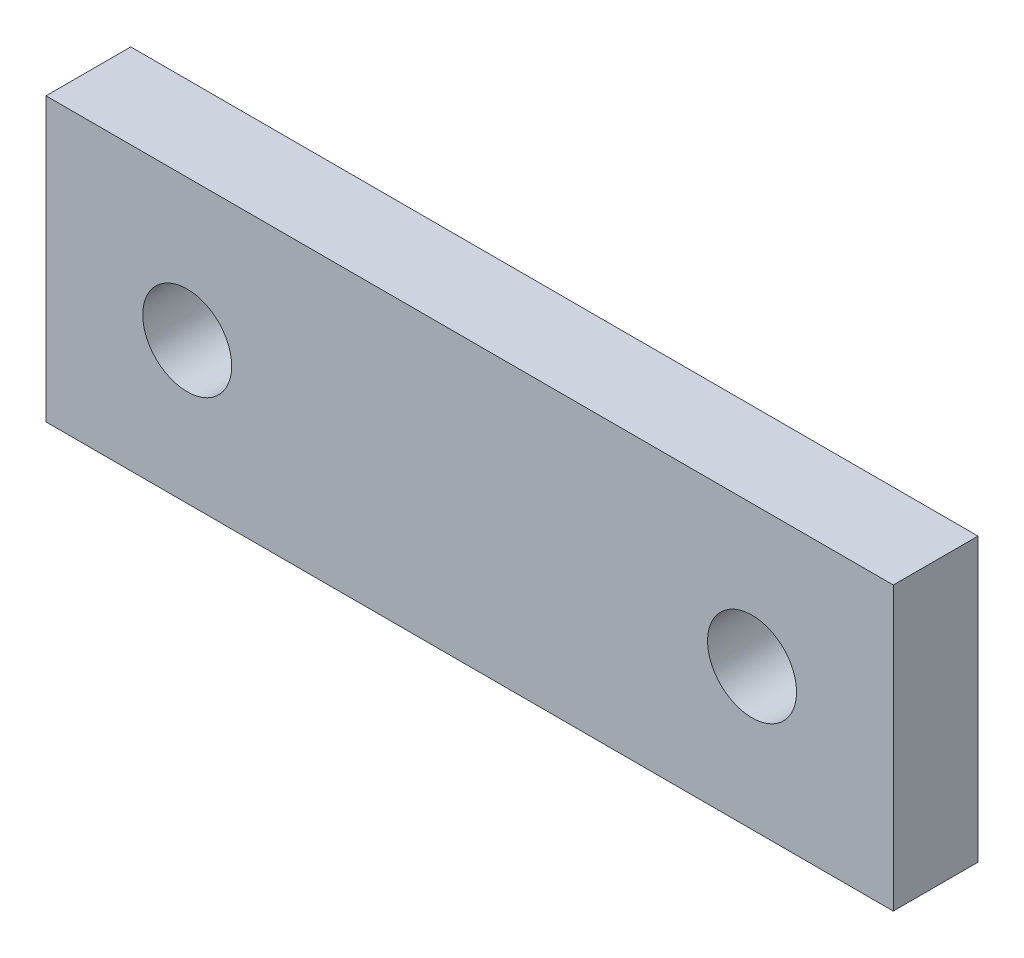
ISO-10303-21;
HEADER;
FILE_DESCRIPTION(('STEP AP214'),'2;1');
FILE_NAME('part.step','',(''),(''),'','','');
FILE_SCHEMA(('AUTOMOTIVE_DESIGN { 1 0 10303 214 1 1 1 1 }'));
ENDSEC;
DATA;
#1=APPLICATION_CONTEXT('core data for automotive mechanical design processes');
#2=APPLICATION_PROTOCOL_DEFINITION('international standard','automotive_design',2000,#1);
#3=PRODUCT_CONTEXT('',#1,'mechanical');
#4=PRODUCT('Part','Part','',(#3));
#5=PRODUCT_RELATED_PRODUCT_CATEGORY('part','',(#4));
#6=PRODUCT_DEFINITION_FORMATION('','',#4);
#7=PRODUCT_DEFINITION_CONTEXT('part definition',#1,'design');
#8=PRODUCT_DEFINITION('design','',#6,#7);
#9=PRODUCT_DEFINITION_SHAPE('','',#8);
#10=(LENGTH_UNIT() NAMED_UNIT(*) SI_UNIT(.MILLI.,.METRE.));
#11=(NAMED_UNIT(*) PLANE_ANGLE_UNIT() SI_UNIT($,.RADIAN.));
#12=(NAMED_UNIT(*) SI_UNIT($,.STERADIAN.) SOLID_ANGLE_UNIT());
#13=UNCERTAINTY_MEASURE_WITH_UNIT(LENGTH_MEASURE(1.E-05),#10,'distance_accuracy_value','');
#14=(GEOMETRIC_REPRESENTATION_CONTEXT(3) GLOBAL_UNCERTAINTY_ASSIGNED_CONTEXT((#13)) GLOBAL_UNIT_ASSIGNED_CONTEXT((#10,
#11,#12)) REPRESENTATION_CONTEXT('',''));
#15=CARTESIAN_POINT('',(0.,0.,0.));
#16=DIRECTION('',(0.,0.,1.));
#17=DIRECTION('',(1.,0.,0.));
#18=AXIS2_PLACEMENT_3D('',#15,#16,#17);
#19=CARTESIAN_POINT('',(38.1,-12.7,7.62));
#20=DIRECTION('',(-1.,0.,0.));
#21=DIRECTION('',(0.,0.,1.));
#22=AXIS2_PLACEMENT_3D('',#19,#20,#21);
#23=PLANE('',#22);
#24=DIRECTION('',(0.,1.,0.));
#25=VECTOR('',#24,1.);
#26=CARTESIAN_POINT('',(38.1,-12.7,0.));
#27=LINE('',#26,#25);
#28=CARTESIAN_POINT('',(38.1,-12.7,0.));
#29=VERTEX_POINT('',#28);
#30=CARTESIAN_POINT('',(38.1,12.7,0.));
#31=VERTEX_POINT('',#30);
#32=EDGE_CURVE('E111',#29,#31,#27,.T.);
#33=ORIENTED_EDGE('',*,*,#32,.T.);
#34=DIRECTION('',(0.,0.,-1.));
#35=VECTOR('',#34,1.);
#36=CARTESIAN_POINT('',(38.1,12.7,7.62));
#37=LINE('',#36,#35);
#38=CARTESIAN_POINT('',(38.1,12.7,7.62));
#39=VERTEX_POINT('',#38);
#40=EDGE_CURVE('E11',#39,#31,#37,.T.);
#41=ORIENTED_EDGE('',*,*,#40,.F.);
#42=DIRECTION('',(0.,1.,0.));
#43=VECTOR('',#42,1.);
#44=CARTESIAN_POINT('',(38.1,-12.7,7.62));
#45=LINE('',#44,#43);
#46=CARTESIAN_POINT('',(38.1,-12.7,7.62));
#47=VERTEX_POINT('',#46);
#48=EDGE_CURVE('E95',#47,#39,#45,.T.);
#49=ORIENTED_EDGE('',*,*,#48,.F.);
#50=DIRECTION('',(0.,0.,-1.));
#51=VECTOR('',#50,1.);
#52=CARTESIAN_POINT('',(38.1,-12.7,7.62));
#53=LINE('',#52,#51);
#54=EDGE_CURVE('E107',#47,#29,#53,.T.);
#55=ORIENTED_EDGE('',*,*,#54,.T.);
#56=EDGE_LOOP('',(#33,#41,#49,#55));
#57=FACE_BOUND('',#56,.T.);
#58=ADVANCED_FACE('F43',(#57),#23,.F.);
#59=CARTESIAN_POINT('',(-38.1,12.7,7.62));
#60=DIRECTION('',(0.,-1.,0.));
#61=DIRECTION('',(0.,0.,-1.));
#62=AXIS2_PLACEMENT_3D('',#59,#60,#61);
#63=PLANE('',#62);
#64=DIRECTION('',(-1.,0.,0.));
#65=VECTOR('',#64,1.);
#66=CARTESIAN_POINT('',(-38.1,12.7,0.));
#67=LINE('',#66,#65);
#68=CARTESIAN_POINT('',(-38.1,12.7,0.));
#69=VERTEX_POINT('',#68);
#70=EDGE_CURVE('E100',#31,#69,#67,.T.);
#71=ORIENTED_EDGE('',*,*,#70,.T.);
#72=DIRECTION('',(0.,0.,-1.));
#73=VECTOR('',#72,1.);
#74=CARTESIAN_POINT('',(-38.1,12.7,7.62));
#75=LINE('',#74,#73);
#76=CARTESIAN_POINT('',(-38.1,12.7,7.62));
#77=VERTEX_POINT('',#76);
#78=EDGE_CURVE('E52',#77,#69,#75,.T.);
#79=ORIENTED_EDGE('',*,*,#78,.F.);
#80=DIRECTION('',(-1.,0.,0.));
#81=VECTOR('',#80,1.);
#82=CARTESIAN_POINT('',(-38.1,12.7,7.62));
#83=LINE('',#82,#81);
#84=EDGE_CURVE('E90',#39,#77,#83,.T.);
#85=ORIENTED_EDGE('',*,*,#84,.F.);
#86=ORIENTED_EDGE('',*,*,#40,.T.);
#87=EDGE_LOOP('',(#71,#79,#85,#86));
#88=FACE_BOUND('',#87,.T.);
#89=ADVANCED_FACE('F99',(#88),#63,.F.);
#90=CARTESIAN_POINT('',(-38.1,-12.7,7.62));
#91=DIRECTION('',(1.,0.,0.));
#92=DIRECTION('',(0.,0.,-1.));
#93=AXIS2_PLACEMENT_3D('',#90,#91,#92);
#94=PLANE('',#93);
#95=DIRECTION('',(0.,-1.,0.));
#96=VECTOR('',#95,1.);
#97=CARTESIAN_POINT('',(-38.1,-12.7,0.));
#98=LINE('',#97,#96);
#99=CARTESIAN_POINT('',(-38.1,-12.7,0.));
#100=VERTEX_POINT('',#99);
#101=EDGE_CURVE('E77',#69,#100,#98,.T.);
#102=ORIENTED_EDGE('',*,*,#101,.T.);
#103=DIRECTION('',(0.,0.,-1.));
#104=VECTOR('',#103,1.);
#105=CARTESIAN_POINT('',(-38.1,-12.7,7.62));
#106=LINE('',#105,#104);
#107=CARTESIAN_POINT('',(-38.1,-12.7,7.62));
#108=VERTEX_POINT('',#107);
#109=EDGE_CURVE('E102',#108,#100,#106,.T.);
#110=ORIENTED_EDGE('',*,*,#109,.F.);
#111=DIRECTION('',(0.,-1.,0.));
#112=VECTOR('',#111,1.);
#113=CARTESIAN_POINT('',(-38.1,-12.7,7.62));
#114=LINE('',#113,#112);
#115=EDGE_CURVE('E93',#77,#108,#114,.T.);
#116=ORIENTED_EDGE('',*,*,#115,.F.);
#117=ORIENTED_EDGE('',*,*,#78,.T.);
#118=EDGE_LOOP('',(#102,#110,#116,#117));
#119=FACE_BOUND('',#118,.T.);
#120=ADVANCED_FACE('F103',(#119),#94,.F.);
#121=CARTESIAN_POINT('',(-38.1,-12.7,7.62));
#122=DIRECTION('',(0.,1.,0.));
#123=DIRECTION('',(0.,0.,1.));
#124=AXIS2_PLACEMENT_3D('',#121,#122,#123);
#125=PLANE('',#124);
#126=DIRECTION('',(1.,0.,0.));
#127=VECTOR('',#126,1.);
#128=CARTESIAN_POINT('',(-38.1,-12.7,0.));
#129=LINE('',#128,#127);
#130=EDGE_CURVE('E83',#100,#29,#129,.T.);
#131=ORIENTED_EDGE('',*,*,#130,.T.);
#132=ORIENTED_EDGE('',*,*,#54,.F.);
#133=DIRECTION('',(1.,0.,0.));
#134=VECTOR('',#133,1.);
#135=CARTESIAN_POINT('',(-38.1,-12.7,7.62));
#136=LINE('',#135,#134);
#137=EDGE_CURVE('E60',#108,#47,#136,.T.);
#138=ORIENTED_EDGE('',*,*,#137,.F.);
#139=ORIENTED_EDGE('',*,*,#109,.T.);
#140=EDGE_LOOP('',(#131,#132,#138,#139));
#141=FACE_BOUND('',#140,.T.);
#142=ADVANCED_FACE('F125',(#141),#125,.F.);
#143=CARTESIAN_POINT('',(0.,0.,7.62));
#144=DIRECTION('',(0.,0.,-1.));
#145=DIRECTION('',(-1.,0.,0.));
#146=AXIS2_PLACEMENT_3D('',#143,#144,#145);
#147=PLANE('',#146);
#148=CARTESIAN_POINT('',(25.4,0.,7.62));
#149=DIRECTION('',(0.,0.,-1.));
#150=DIRECTION('',(-1.,0.,0.));
#151=AXIS2_PLACEMENT_3D('',#148,#149,#150);
#152=CIRCLE('',#151,4.00000000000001);
#153=CARTESIAN_POINT('',(29.4,0.,7.62));
#154=VERTEX_POINT('',#153);
#155=EDGE_CURVE('E140',#154,#154,#152,.T.);
#156=ORIENTED_EDGE('',*,*,#155,.T.);
#157=EDGE_LOOP('',(#156));
#158=FACE_BOUND('',#157,.T.);
#159=CARTESIAN_POINT('',(-25.4,0.,7.62));
#160=DIRECTION('',(0.,0.,1.));
#161=DIRECTION('',(1.,0.,0.));
#162=AXIS2_PLACEMENT_3D('',#159,#160,#161);
#163=CIRCLE('',#162,4.00000000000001);
#164=CARTESIAN_POINT('',(-21.4,0.,7.62));
#165=VERTEX_POINT('',#164);
#166=EDGE_CURVE('E132',#165,#165,#163,.T.);
#167=ORIENTED_EDGE('',*,*,#166,.F.);
#168=EDGE_LOOP('',(#167));
#169=FACE_BOUND('',#168,.T.);
#170=ORIENTED_EDGE('',*,*,#48,.T.);
#171=ORIENTED_EDGE('',*,*,#84,.T.);
#172=ORIENTED_EDGE('',*,*,#115,.T.);
#173=ORIENTED_EDGE('',*,*,#137,.T.);
#174=EDGE_LOOP('',(#170,#171,#172,#173));
#175=FACE_BOUND('',#174,.T.);
#176=ADVANCED_FACE('F91',(#158,#169,#175),#147,.F.);
#177=CARTESIAN_POINT('',(0.,0.,0.));
#178=DIRECTION('',(0.,0.,-1.));
#179=DIRECTION('',(-1.,0.,0.));
#180=AXIS2_PLACEMENT_3D('',#177,#178,#179);
#181=PLANE('',#180);
#182=CARTESIAN_POINT('',(25.4,0.,0.));
#183=DIRECTION('',(0.,0.,-1.));
#184=DIRECTION('',(-1.,0.,0.));
#185=AXIS2_PLACEMENT_3D('',#182,#183,#184);
#186=CIRCLE('',#185,4.00000000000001);
#187=CARTESIAN_POINT('',(29.4,0.,0.));
#188=VERTEX_POINT('',#187);
#189=EDGE_CURVE('E136',#188,#188,#186,.T.);
#190=ORIENTED_EDGE('',*,*,#189,.F.);
#191=EDGE_LOOP('',(#190));
#192=FACE_BOUND('',#191,.T.);
#193=CARTESIAN_POINT('',(-25.4,0.,0.));
#194=DIRECTION('',(0.,0.,1.));
#195=DIRECTION('',(1.,0.,0.));
#196=AXIS2_PLACEMENT_3D('',#193,#194,#195);
#197=CIRCLE('',#196,4.00000000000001);
#198=CARTESIAN_POINT('',(-21.4,0.,0.));
#199=VERTEX_POINT('',#198);
#200=EDGE_CURVE('E115',#199,#199,#197,.T.);
#201=ORIENTED_EDGE('',*,*,#200,.T.);
#202=EDGE_LOOP('',(#201));
#203=FACE_BOUND('',#202,.T.);
#204=ORIENTED_EDGE('',*,*,#32,.F.);
#205=ORIENTED_EDGE('',*,*,#130,.F.);
#206=ORIENTED_EDGE('',*,*,#101,.F.);
#207=ORIENTED_EDGE('',*,*,#70,.F.);
#208=EDGE_LOOP('',(#204,#205,#206,#207));
#209=FACE_BOUND('',#208,.T.);
#210=ADVANCED_FACE('F128',(#192,#203,#209),#181,.T.);
#211=CARTESIAN_POINT('',(-25.4,0.,0.));
#212=DIRECTION('',(0.,0.,1.));
#213=DIRECTION('',(1.,0.,0.));
#214=AXIS2_PLACEMENT_3D('',#211,#212,#213);
#215=CYLINDRICAL_SURFACE('',#214,4.00000000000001);
#216=CARTESIAN_POINT('',(-21.4,0.,0.));
#217=CARTESIAN_POINT('',(-21.4,0.,0.0793749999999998));
#218=CARTESIAN_POINT('',(-21.4,0.,0.15875));
#219=CARTESIAN_POINT('',(-21.4,0.,0.3175));
#220=CARTESIAN_POINT('',(-21.4,0.,0.396875));
#221=CARTESIAN_POINT('',(-21.4,0.,0.555625));
#222=CARTESIAN_POINT('',(-21.4,0.,0.635));
#223=CARTESIAN_POINT('',(-21.4,0.,0.79375));
#224=CARTESIAN_POINT('',(-21.4,0.,0.873125));
#225=CARTESIAN_POINT('',(-21.4,0.,1.031875));
#226=CARTESIAN_POINT('',(-21.4,0.,1.11125));
#227=CARTESIAN_POINT('',(-21.4,0.,1.27));
#228=CARTESIAN_POINT('',(-21.4,0.,1.349375));
#229=CARTESIAN_POINT('',(-21.4,0.,1.508125));
#230=CARTESIAN_POINT('',(-21.4,0.,1.5875));
#231=CARTESIAN_POINT('',(-21.4,0.,1.74625));
#232=CARTESIAN_POINT('',(-21.4,0.,1.825625));
#233=CARTESIAN_POINT('',(-21.4,0.,1.984375));
#234=CARTESIAN_POINT('',(-21.4,0.,2.06375));
#235=CARTESIAN_POINT('',(-21.4,0.,2.2225));
#236=CARTESIAN_POINT('',(-21.4,0.,2.301875));
#237=CARTESIAN_POINT('',(-21.4,0.,2.460625));
#238=CARTESIAN_POINT('',(-21.4,0.,2.54));
#239=CARTESIAN_POINT('',(-21.4,0.,2.69875));
#240=CARTESIAN_POINT('',(-21.4,0.,2.778125));
#241=CARTESIAN_POINT('',(-21.4,0.,2.936875));
#242=CARTESIAN_POINT('',(-21.4,0.,3.01625));
#243=CARTESIAN_POINT('',(-21.4,0.,3.175));
#244=CARTESIAN_POINT('',(-21.4,0.,3.254375));
#245=CARTESIAN_POINT('',(-21.4,0.,3.413125));
#246=CARTESIAN_POINT('',(-21.4,0.,3.4925));
#247=CARTESIAN_POINT('',(-21.4,0.,3.65125));
#248=CARTESIAN_POINT('',(-21.4,0.,3.730625));
#249=CARTESIAN_POINT('',(-21.4,0.,3.889375));
#250=CARTESIAN_POINT('',(-21.4,0.,3.96875));
#251=CARTESIAN_POINT('',(-21.4,0.,4.1275));
#252=CARTESIAN_POINT('',(-21.4,0.,4.206875));
#253=CARTESIAN_POINT('',(-21.4,0.,4.365625));
#254=CARTESIAN_POINT('',(-21.4,0.,4.445));
#255=CARTESIAN_POINT('',(-21.4,0.,4.60375));
#256=CARTESIAN_POINT('',(-21.4,0.,4.683125));
#257=CARTESIAN_POINT('',(-21.4,0.,4.841875));
#258=CARTESIAN_POINT('',(-21.4,0.,4.92125));
#259=CARTESIAN_POINT('',(-21.4,0.,5.08));
#260=CARTESIAN_POINT('',(-21.4,0.,5.159375));
#261=CARTESIAN_POINT('',(-21.4,0.,5.318125));
#262=CARTESIAN_POINT('',(-21.4,0.,5.3975));
#263=CARTESIAN_POINT('',(-21.4,0.,5.55625));
#264=CARTESIAN_POINT('',(-21.4,0.,5.635625));
#265=CARTESIAN_POINT('',(-21.4,0.,5.794375));
#266=CARTESIAN_POINT('',(-21.4,0.,5.87375));
#267=CARTESIAN_POINT('',(-21.4,0.,6.0325));
#268=CARTESIAN_POINT('',(-21.4,0.,6.111875));
#269=CARTESIAN_POINT('',(-21.4,0.,6.270625));
#270=CARTESIAN_POINT('',(-21.4,0.,6.35));
#271=CARTESIAN_POINT('',(-21.4,0.,6.50875));
#272=CARTESIAN_POINT('',(-21.4,0.,6.588125));
#273=CARTESIAN_POINT('',(-21.4,0.,6.746875));
#274=CARTESIAN_POINT('',(-21.4,0.,6.82625));
#275=CARTESIAN_POINT('',(-21.4,0.,6.985));
#276=CARTESIAN_POINT('',(-21.4,0.,7.064375));
#277=CARTESIAN_POINT('',(-21.4,0.,7.223125));
#278=CARTESIAN_POINT('',(-21.4,0.,7.3025));
#279=CARTESIAN_POINT('',(-21.4,0.,7.46125));
#280=CARTESIAN_POINT('',(-21.4,0.,7.540625));
#281=CARTESIAN_POINT('',(-21.4,0.,7.62));
#282=B_SPLINE_CURVE_WITH_KNOTS('',3,(#216,#217,#218,#219,#220,#221,#222,#223,#224,#225,#226,
#227,#228,#229,#230,#231,#232,#233,#234,#235,#236,#237,#238,#239,#240,#241,#242,#243,#244,#245,
#246,#247,#248,#249,#250,#251,#252,#253,#254,#255,#256,#257,#258,#259,#260,#261,#262,#263,#264,
#265,#266,#267,#268,#269,#270,#271,#272,#273,#274,#275,#276,#277,#278,#279,#280,#281),
.UNSPECIFIED.,.F.,.F.,(4,2,2,2,2,2,2,2,2,2,2,2,2,2,2,2,2,2,2,2,2,2,2,2,2,2,2,2,2,2,2,2,4),(0.,
0.238125,0.47625,0.714375,0.9525,1.190625,1.42875,1.666875,1.905,2.143125,2.38125,2.619375,
2.8575,3.095625,3.33375,3.571875,3.81,4.048125,4.28625,4.524375,4.7625,5.000625,5.23875,
5.476875,5.715,5.953125,6.19125,6.429375,6.6675,6.905625,7.14375,7.381875,7.62),.UNSPECIFIED.);
#283=EDGE_CURVE('BSEAM153',#199,#165,#282,.T.);
#284=ORIENTED_EDGE('',*,*,#200,.F.);
#285=ORIENTED_EDGE('',*,*,#166,.T.);
#286=ORIENTED_EDGE('',*,*,#283,.T.);
#287=ORIENTED_EDGE('',*,*,#283,.F.);
#288=EDGE_LOOP('',(#284,#286,#285,#287));
#289=FACE_BOUND('',#288,.T.);
#290=ADVANCED_FACE('F153',(#289),#215,.F.);
#291=CARTESIAN_POINT('',(25.4,0.,0.));
#292=DIRECTION('',(0.,0.,1.));
#293=DIRECTION('',(1.,0.,0.));
#294=AXIS2_PLACEMENT_3D('',#291,#292,#293);
#295=CYLINDRICAL_SURFACE('',#294,4.00000000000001);
#296=CARTESIAN_POINT('',(29.4,0.,0.));
#297=CARTESIAN_POINT('',(29.4,0.,0.0793749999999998));
#298=CARTESIAN_POINT('',(29.4,0.,0.15875));
#299=CARTESIAN_POINT('',(29.4,0.,0.3175));
#300=CARTESIAN_POINT('',(29.4,0.,0.396875));
#301=CARTESIAN_POINT('',(29.4,0.,0.555625));
#302=CARTESIAN_POINT('',(29.4,0.,0.635));
#303=CARTESIAN_POINT('',(29.4,0.,0.79375));
#304=CARTESIAN_POINT('',(29.4,0.,0.873125));
#305=CARTESIAN_POINT('',(29.4,0.,1.031875));
#306=CARTESIAN_POINT('',(29.4,0.,1.11125));
#307=CARTESIAN_POINT('',(29.4,0.,1.27));
#308=CARTESIAN_POINT('',(29.4,0.,1.349375));
#309=CARTESIAN_POINT('',(29.4,0.,1.508125));
#310=CARTESIAN_POINT('',(29.4,0.,1.5875));
#311=CARTESIAN_POINT('',(29.4,0.,1.74625));
#312=CARTESIAN_POINT('',(29.4,0.,1.825625));
#313=CARTESIAN_POINT('',(29.4,0.,1.984375));
#314=CARTESIAN_POINT('',(29.4,0.,2.06375));
#315=CARTESIAN_POINT('',(29.4,0.,2.2225));
#316=CARTESIAN_POINT('',(29.4,0.,2.301875));
#317=CARTESIAN_POINT('',(29.4,0.,2.460625));
#318=CARTESIAN_POINT('',(29.4,0.,2.54));
#319=CARTESIAN_POINT('',(29.4,0.,2.69875));
#320=CARTESIAN_POINT('',(29.4,0.,2.778125));
#321=CARTESIAN_POINT('',(29.4,0.,2.936875));
#322=CARTESIAN_POINT('',(29.4,0.,3.01625));
#323=CARTESIAN_POINT('',(29.4,0.,3.175));
#324=CARTESIAN_POINT('',(29.4,0.,3.254375));
#325=CARTESIAN_POINT('',(29.4,0.,3.413125));
#326=CARTESIAN_POINT('',(29.4,0.,3.4925));
#327=CARTESIAN_POINT('',(29.4,0.,3.65125));
#328=CARTESIAN_POINT('',(29.4,0.,3.730625));
#329=CARTESIAN_POINT('',(29.4,0.,3.889375));
#330=CARTESIAN_POINT('',(29.4,0.,3.96875));
#331=CARTESIAN_POINT('',(29.4,0.,4.1275));
#332=CARTESIAN_POINT('',(29.4,0.,4.206875));
#333=CARTESIAN_POINT('',(29.4,0.,4.365625));
#334=CARTESIAN_POINT('',(29.4,0.,4.445));
#335=CARTESIAN_POINT('',(29.4,0.,4.60375));
#336=CARTESIAN_POINT('',(29.4,0.,4.683125));
#337=CARTESIAN_POINT('',(29.4,0.,4.841875));
#338=CARTESIAN_POINT('',(29.4,0.,4.92125));
#339=CARTESIAN_POINT('',(29.4,0.,5.08));
#340=CARTESIAN_POINT('',(29.4,0.,5.159375));
#341=CARTESIAN_POINT('',(29.4,0.,5.318125));
#342=CARTESIAN_POINT('',(29.4,0.,5.3975));
#343=CARTESIAN_POINT('',(29.4,0.,5.55625));
#344=CARTESIAN_POINT('',(29.4,0.,5.635625));
#345=CARTESIAN_POINT('',(29.4,0.,5.794375));
#346=CARTESIAN_POINT('',(29.4,0.,5.87375));
#347=CARTESIAN_POINT('',(29.4,0.,6.0325));
#348=CARTESIAN_POINT('',(29.4,0.,6.111875));
#349=CARTESIAN_POINT('',(29.4,0.,6.270625));
#350=CARTESIAN_POINT('',(29.4,0.,6.35));
#351=CARTESIAN_POINT('',(29.4,0.,6.50875));
#352=CARTESIAN_POINT('',(29.4,0.,6.588125));
#353=CARTESIAN_POINT('',(29.4,0.,6.746875));
#354=CARTESIAN_POINT('',(29.4,0.,6.82625));
#355=CARTESIAN_POINT('',(29.4,0.,6.985));
#356=CARTESIAN_POINT('',(29.4,0.,7.064375));
#357=CARTESIAN_POINT('',(29.4,0.,7.223125));
#358=CARTESIAN_POINT('',(29.4,0.,7.3025));
#359=CARTESIAN_POINT('',(29.4,0.,7.46125));
#360=CARTESIAN_POINT('',(29.4,0.,7.540625));
#361=CARTESIAN_POINT('',(29.4,0.,7.62));
#362=B_SPLINE_CURVE_WITH_KNOTS('',3,(#296,#297,#298,#299,#300,#301,#302,#303,#304,#305,#306,
#307,#308,#309,#310,#311,#312,#313,#314,#315,#316,#317,#318,#319,#320,#321,#322,#323,#324,#325,
#326,#327,#328,#329,#330,#331,#332,#333,#334,#335,#336,#337,#338,#339,#340,#341,#342,#343,#344,
#345,#346,#347,#348,#349,#350,#351,#352,#353,#354,#355,#356,#357,#358,#359,#360,#361),
.UNSPECIFIED.,.F.,.F.,(4,2,2,2,2,2,2,2,2,2,2,2,2,2,2,2,2,2,2,2,2,2,2,2,2,2,2,2,2,2,2,2,4),(0.,
0.238125,0.47625,0.714375,0.9525,1.190625,1.42875,1.666875,1.905,2.143125,2.38125,2.619375,
2.8575,3.095625,3.33375,3.571875,3.81,4.048125,4.28625,4.524375,4.7625,5.000625,5.23875,
5.476875,5.715,5.953125,6.19125,6.429375,6.6675,6.905625,7.14375,7.381875,7.62),.UNSPECIFIED.);
#363=EDGE_CURVE('BSEAM148',#188,#154,#362,.T.);
#364=ORIENTED_EDGE('',*,*,#189,.T.);
#365=ORIENTED_EDGE('',*,*,#155,.F.);
#366=ORIENTED_EDGE('',*,*,#363,.T.);
#367=ORIENTED_EDGE('',*,*,#363,.F.);
#368=EDGE_LOOP('',(#364,#366,#365,#367));
#369=FACE_BOUND('',#368,.T.);
#370=ADVANCED_FACE('F148',(#369),#295,.F.);
#371=CLOSED_SHELL('',(#58,#89,#120,#142,#176,#210,#290,#370));
#372=MANIFOLD_SOLID_BREP('B2',#371);
#373=ADVANCED_BREP_SHAPE_REPRESENTATION('',(#18,#372),#14);
#374=SHAPE_DEFINITION_REPRESENTATION(#9,#373);
ENDSEC;
END-ISO-10303-21;
